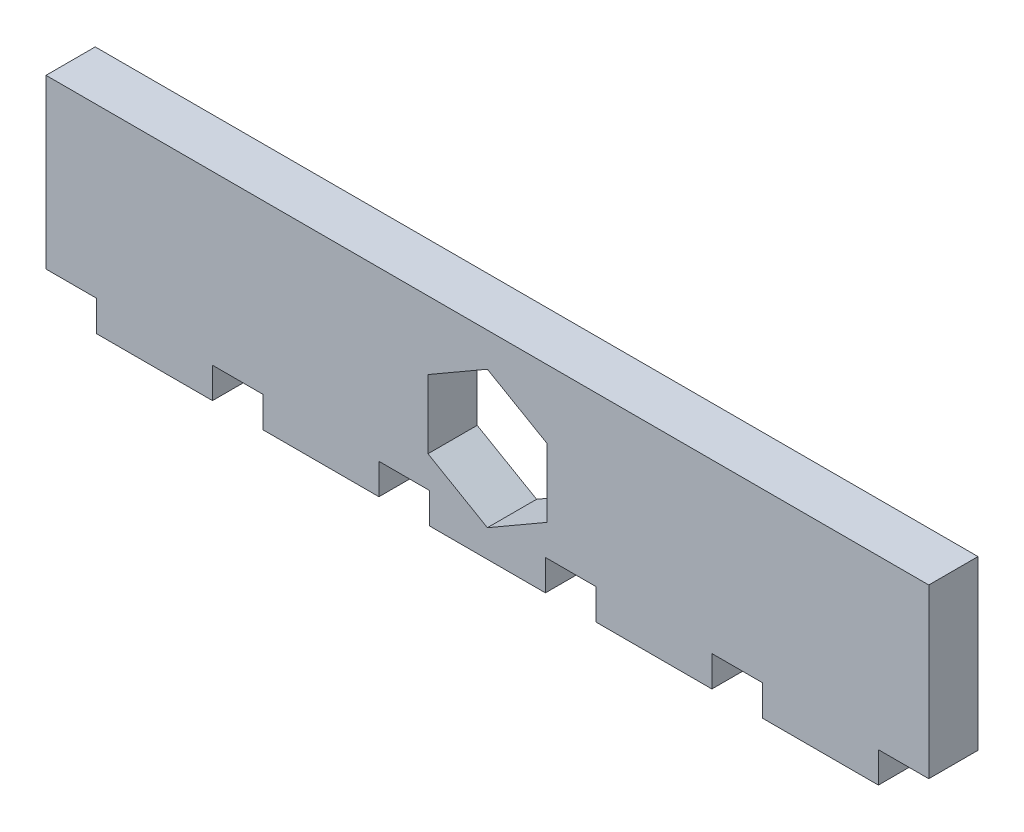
from build123d import *

# Parameters (mm, degrees)
BOSS_EXTRUDE1_DEPTH = 5.3848


with BuildPart() as part:
    # Sketch2 → Boss-Extrude1 (new body)
    with BuildSketch(Plane.XY):
        Polygon((215.182280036, 259.030257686), (118.611480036, 259.030257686), (118.611480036, 240.672505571), (124.123280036, 240.672505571), (124.123280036, 237.313031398), (136.823280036, 237.313031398), (136.823280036, 240.672505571), (142.335080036, 240.672505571), (142.335080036, 237.313031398), (155.035080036, 237.313031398), (155.035080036, 240.672505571), (160.546880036, 240.672505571), (160.546880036, 237.313031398), (173.246880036, 237.313031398), (173.246880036, 240.672505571), (178.758680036, 240.672505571), (178.758680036, 237.313031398), (191.458680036, 237.313031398), (191.458680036, 240.672505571), (196.970480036, 240.672505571), (196.970480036, 237.313031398), (209.670480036, 237.313031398), (209.670480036, 240.672505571), (215.182280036, 240.672505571), align=None)
        Polygon((166.896880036, 255.325933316), (160.396880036, 251.573156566), (160.396880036, 244.067603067), (166.896880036, 240.314826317), (173.396880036, 244.067603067), (173.396880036, 251.573156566), align=None, mode=Mode.SUBTRACT)
    extrude(amount=BOSS_EXTRUDE1_DEPTH)


solid = part.part
